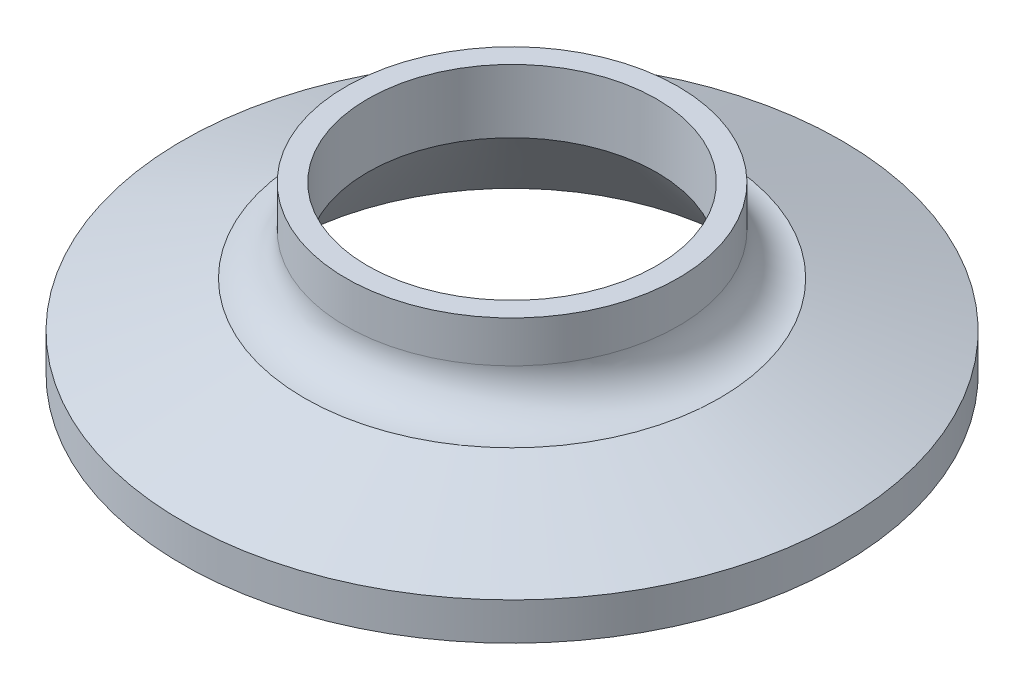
ISO-10303-21;
HEADER;
FILE_DESCRIPTION(('STEP AP214'),'2;1');
FILE_NAME('part.step','',(''),(''),'','','');
FILE_SCHEMA(('AUTOMOTIVE_DESIGN { 1 0 10303 214 1 1 1 1 }'));
ENDSEC;
DATA;
#1=APPLICATION_CONTEXT('core data for automotive mechanical design processes');
#2=APPLICATION_PROTOCOL_DEFINITION('international standard','automotive_design',2000,#1);
#3=PRODUCT_CONTEXT('',#1,'mechanical');
#4=PRODUCT('Part','Part','',(#3));
#5=PRODUCT_RELATED_PRODUCT_CATEGORY('part','',(#4));
#6=PRODUCT_DEFINITION_FORMATION('','',#4);
#7=PRODUCT_DEFINITION_CONTEXT('part definition',#1,'design');
#8=PRODUCT_DEFINITION('design','',#6,#7);
#9=PRODUCT_DEFINITION_SHAPE('','',#8);
#10=(LENGTH_UNIT() NAMED_UNIT(*) SI_UNIT(.MILLI.,.METRE.));
#11=(NAMED_UNIT(*) PLANE_ANGLE_UNIT() SI_UNIT($,.RADIAN.));
#12=(NAMED_UNIT(*) SI_UNIT($,.STERADIAN.) SOLID_ANGLE_UNIT());
#13=UNCERTAINTY_MEASURE_WITH_UNIT(LENGTH_MEASURE(1.E-05),#10,'distance_accuracy_value','');
#14=(GEOMETRIC_REPRESENTATION_CONTEXT(3) GLOBAL_UNCERTAINTY_ASSIGNED_CONTEXT((#13)) GLOBAL_UNIT_ASSIGNED_CONTEXT((#10,
#11,#12)) REPRESENTATION_CONTEXT('',''));
#15=CARTESIAN_POINT('',(0.,0.,0.));
#16=DIRECTION('',(0.,0.,1.));
#17=DIRECTION('',(1.,0.,0.));
#18=AXIS2_PLACEMENT_3D('',#15,#16,#17);
#19=CARTESIAN_POINT('',(-11.049,12.7,0.));
#20=DIRECTION('',(0.,-1.,0.));
#21=DIRECTION('',(0.,0.,-1.));
#22=AXIS2_PLACEMENT_3D('',#19,#20,#21);
#23=PLANE('',#22);
#24=CARTESIAN_POINT('',(0.,12.7,0.));
#25=DIRECTION('',(0.,-1.,0.));
#26=DIRECTION('',(0.,0.,-1.));
#27=AXIS2_PLACEMENT_3D('',#24,#25,#26);
#28=CIRCLE('',#27,12.7);
#29=CARTESIAN_POINT('',(0.,12.7,-12.7));
#30=VERTEX_POINT('',#29);
#31=EDGE_CURVE('E12',#30,#30,#28,.T.);
#32=ORIENTED_EDGE('',*,*,#31,.F.);
#33=EDGE_LOOP('',(#32));
#34=FACE_BOUND('',#33,.T.);
#35=CARTESIAN_POINT('',(0.,12.7,0.));
#36=DIRECTION('',(0.,-1.,0.));
#37=DIRECTION('',(0.,0.,-1.));
#38=AXIS2_PLACEMENT_3D('',#35,#36,#37);
#39=CIRCLE('',#38,11.049);
#40=CARTESIAN_POINT('',(0.,12.7,-11.049));
#41=VERTEX_POINT('',#40);
#42=EDGE_CURVE('E92',#41,#41,#39,.T.);
#43=ORIENTED_EDGE('',*,*,#42,.T.);
#44=EDGE_LOOP('',(#43));
#45=FACE_BOUND('',#44,.T.);
#46=ADVANCED_FACE('F43',(#34,#45),#23,.F.);
#47=CARTESIAN_POINT('',(0.,0.,0.));
#48=DIRECTION('',(0.,-1.,0.));
#49=DIRECTION('',(0.,0.,-1.));
#50=AXIS2_PLACEMENT_3D('',#47,#48,#49);
#51=CYLINDRICAL_SURFACE('',#50,12.7);
#52=CARTESIAN_POINT('',(0.,9.52500000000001,0.));
#53=DIRECTION('',(0.,-1.,0.));
#54=DIRECTION('',(0.,0.,-1.));
#55=AXIS2_PLACEMENT_3D('',#52,#53,#54);
#56=CIRCLE('',#55,12.7);
#57=CARTESIAN_POINT('',(0.,9.52500000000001,-12.7));
#58=VERTEX_POINT('',#57);
#59=EDGE_CURVE('E49',#58,#58,#56,.T.);
#60=ORIENTED_EDGE('',*,*,#59,.F.);
#61=EDGE_LOOP('',(#60));
#62=FACE_BOUND('',#61,.T.);
#63=ORIENTED_EDGE('',*,*,#31,.T.);
#64=EDGE_LOOP('',(#63));
#65=FACE_BOUND('',#64,.T.);
#66=ADVANCED_FACE('F171',(#62,#65),#51,.T.);
#67=CARTESIAN_POINT('',(0.,9.52500000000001,0.));
#68=DIRECTION('',(0.,-1.,0.));
#69=DIRECTION('',(0.,0.,-1.));
#70=AXIS2_PLACEMENT_3D('',#67,#68,#69);
#71=TOROIDAL_SURFACE('',#70,15.875,3.175);
#72=CARTESIAN_POINT('',(0.,6.34999999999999,0.));
#73=DIRECTION('',(0.,-1.,0.));
#74=DIRECTION('',(0.,0.,-1.));
#75=AXIS2_PLACEMENT_3D('',#72,#73,#74);
#76=CIRCLE('',#75,15.875);
#77=CARTESIAN_POINT('',(0.,6.35,-15.875));
#78=VERTEX_POINT('',#77);
#79=EDGE_CURVE('E53',#78,#78,#76,.T.);
#80=ORIENTED_EDGE('',*,*,#79,.F.);
#81=EDGE_LOOP('',(#80));
#82=FACE_BOUND('',#81,.T.);
#83=ORIENTED_EDGE('',*,*,#59,.T.);
#84=EDGE_LOOP('',(#83));
#85=FACE_BOUND('',#84,.T.);
#86=ADVANCED_FACE('F166',(#82,#85),#71,.F.);
#87=CARTESIAN_POINT('',(-15.875,6.34999999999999,0.));
#88=DIRECTION('',(0.,1.,0.));
#89=DIRECTION('',(0.,0.,1.));
#90=AXIS2_PLACEMENT_3D('',#87,#88,#89);
#91=PLANE('',#90);
#92=CARTESIAN_POINT('',(0.,6.34999999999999,0.));
#93=DIRECTION('',(0.,-1.,0.));
#94=DIRECTION('',(0.,0.,-1.));
#95=AXIS2_PLACEMENT_3D('',#92,#93,#94);
#96=CIRCLE('',#95,15.6301961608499);
#97=CARTESIAN_POINT('',(0.,6.35,-15.6301961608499));
#98=VERTEX_POINT('',#97);
#99=EDGE_CURVE('E57',#98,#98,#96,.T.);
#100=ORIENTED_EDGE('',*,*,#99,.F.);
#101=EDGE_LOOP('',(#100));
#102=FACE_BOUND('',#101,.T.);
#103=ORIENTED_EDGE('',*,*,#79,.T.);
#104=EDGE_LOOP('',(#103));
#105=FACE_BOUND('',#104,.T.);
#106=ADVANCED_FACE('F160',(#102,#105),#91,.F.);
#107=CARTESIAN_POINT('',(0.,6.34999999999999,0.));
#108=DIRECTION('',(0.,-1.,0.));
#109=DIRECTION('',(0.,0.,-1.));
#110=AXIS2_PLACEMENT_3D('',#107,#108,#109);
#111=CONICAL_SURFACE('',#110,15.6301961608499,1.22173047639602);
#112=CARTESIAN_POINT('',(0.,2.8680409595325,0.));
#113=DIRECTION('',(0.,-1.,0.));
#114=DIRECTION('',(0.,0.,-1.));
#115=AXIS2_PLACEMENT_3D('',#112,#113,#114);
#116=CIRCLE('',#115,25.1968);
#117=CARTESIAN_POINT('',(0.,2.8680409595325,-25.1968));
#118=VERTEX_POINT('',#117);
#119=EDGE_CURVE('E62',#118,#118,#116,.T.);
#120=ORIENTED_EDGE('',*,*,#119,.F.);
#121=EDGE_LOOP('',(#120));
#122=FACE_BOUND('',#121,.T.);
#123=ORIENTED_EDGE('',*,*,#99,.T.);
#124=EDGE_LOOP('',(#123));
#125=FACE_BOUND('',#124,.T.);
#126=ADVANCED_FACE('F154',(#122,#125),#111,.T.);
#127=CARTESIAN_POINT('',(0.,0.,0.));
#128=DIRECTION('',(0.,-1.,0.));
#129=DIRECTION('',(0.,0.,-1.));
#130=AXIS2_PLACEMENT_3D('',#127,#128,#129);
#131=CYLINDRICAL_SURFACE('',#130,25.1968);
#132=CARTESIAN_POINT('',(0.,0.,0.));
#133=DIRECTION('',(0.,-1.,0.));
#134=DIRECTION('',(0.,0.,-1.));
#135=AXIS2_PLACEMENT_3D('',#132,#133,#134);
#136=CIRCLE('',#135,25.1968);
#137=CARTESIAN_POINT('',(0.,0.,-25.1968));
#138=VERTEX_POINT('',#137);
#139=EDGE_CURVE('E65',#138,#138,#136,.T.);
#140=ORIENTED_EDGE('',*,*,#139,.F.);
#141=EDGE_LOOP('',(#140));
#142=FACE_BOUND('',#141,.T.);
#143=ORIENTED_EDGE('',*,*,#119,.T.);
#144=EDGE_LOOP('',(#143));
#145=FACE_BOUND('',#144,.T.);
#146=ADVANCED_FACE('F148',(#142,#145),#131,.T.);
#147=CARTESIAN_POINT('',(-25.1968,0.,0.));
#148=DIRECTION('',(0.,1.,0.));
#149=DIRECTION('',(0.,0.,1.));
#150=AXIS2_PLACEMENT_3D('',#147,#148,#149);
#151=PLANE('',#150);
#152=CARTESIAN_POINT('',(0.,0.,0.));
#153=DIRECTION('',(0.,-1.,0.));
#154=DIRECTION('',(0.,0.,-1.));
#155=AXIS2_PLACEMENT_3D('',#152,#153,#154);
#156=CIRCLE('',#155,23.8091722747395);
#157=CARTESIAN_POINT('',(0.,0.,-23.8091722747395));
#158=VERTEX_POINT('',#157);
#159=EDGE_CURVE('E68',#158,#158,#156,.T.);
#160=ORIENTED_EDGE('',*,*,#159,.F.);
#161=EDGE_LOOP('',(#160));
#162=FACE_BOUND('',#161,.T.);
#163=ORIENTED_EDGE('',*,*,#139,.T.);
#164=EDGE_LOOP('',(#163));
#165=FACE_BOUND('',#164,.T.);
#166=ADVANCED_FACE('F142',(#162,#165),#151,.F.);
#167=CARTESIAN_POINT('',(0.,0.787399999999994,0.));
#168=DIRECTION('',(0.,-1.,0.));
#169=DIRECTION('',(0.,0.,-1.));
#170=AXIS2_PLACEMENT_3D('',#167,#168,#169);
#171=TOROIDAL_SURFACE('',#170,23.8091722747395,0.787399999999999);
#172=CARTESIAN_POINT('',(0.,0.479738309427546,0.));
#173=DIRECTION('',(0.,-1.,0.));
#174=DIRECTION('',(0.,0.,-1.));
#175=AXIS2_PLACEMENT_3D('',#172,#173,#174);
#176=CIRCLE('',#175,23.0843667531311);
#177=CARTESIAN_POINT('',(0.,0.479738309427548,-23.0843667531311));
#178=VERTEX_POINT('',#177);
#179=EDGE_CURVE('E71',#178,#178,#176,.T.);
#180=ORIENTED_EDGE('',*,*,#179,.F.);
#181=EDGE_LOOP('',(#180));
#182=FACE_BOUND('',#181,.T.);
#183=ORIENTED_EDGE('',*,*,#159,.T.);
#184=EDGE_LOOP('',(#183));
#185=FACE_BOUND('',#184,.T.);
#186=ADVANCED_FACE('F136',(#182,#185),#171,.T.);
#187=CARTESIAN_POINT('',(0.,0.479738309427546,0.));
#188=DIRECTION('',(0.,-1.,0.));
#189=DIRECTION('',(0.,0.,-1.));
#190=AXIS2_PLACEMENT_3D('',#187,#188,#189);
#191=CONICAL_SURFACE('',#190,23.0843667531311,0.401425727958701);
#192=CARTESIAN_POINT('',(0.,0.872854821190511,0.));
#193=DIRECTION('',(0.,-1.,0.));
#194=DIRECTION('',(0.,0.,-1.));
#195=AXIS2_PLACEMENT_3D('',#192,#193,#194);
#196=CIRCLE('',#195,22.9174986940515);
#197=CARTESIAN_POINT('',(0.,0.872854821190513,-22.9174986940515));
#198=VERTEX_POINT('',#197);
#199=EDGE_CURVE('E74',#198,#198,#196,.T.);
#200=ORIENTED_EDGE('',*,*,#199,.F.);
#201=EDGE_LOOP('',(#200));
#202=FACE_BOUND('',#201,.T.);
#203=ORIENTED_EDGE('',*,*,#179,.T.);
#204=EDGE_LOOP('',(#203));
#205=FACE_BOUND('',#204,.T.);
#206=ADVANCED_FACE('F130',(#202,#205),#191,.F.);
#207=CARTESIAN_POINT('',(0.,0.406400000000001,0.));
#208=DIRECTION('',(0.,-1.,0.));
#209=DIRECTION('',(0.,0.,-1.));
#210=AXIS2_PLACEMENT_3D('',#207,#208,#209);
#211=TOROIDAL_SURFACE('',#210,21.8186,1.1938);
#212=CARTESIAN_POINT('',(0.,0.872854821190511,0.));
#213=DIRECTION('',(0.,-1.,0.));
#214=DIRECTION('',(0.,0.,-1.));
#215=AXIS2_PLACEMENT_3D('',#212,#213,#214);
#216=CIRCLE('',#215,20.7197013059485);
#217=CARTESIAN_POINT('',(0.,0.872854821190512,-20.7197013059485));
#218=VERTEX_POINT('',#217);
#219=EDGE_CURVE('E77',#218,#218,#216,.T.);
#220=ORIENTED_EDGE('',*,*,#219,.F.);
#221=EDGE_LOOP('',(#220));
#222=FACE_BOUND('',#221,.T.);
#223=ORIENTED_EDGE('',*,*,#199,.T.);
#224=EDGE_LOOP('',(#223));
#225=FACE_BOUND('',#224,.T.);
#226=ADVANCED_FACE('F124',(#222,#225),#211,.F.);
#227=CARTESIAN_POINT('',(0.,0.872854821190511,0.));
#228=DIRECTION('',(0.,1.,0.));
#229=DIRECTION('',(0.,0.,1.));
#230=AXIS2_PLACEMENT_3D('',#227,#228,#229);
#231=CONICAL_SURFACE('',#230,20.7197013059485,0.401425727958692);
#232=CARTESIAN_POINT('',(0.,0.479738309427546,0.));
#233=DIRECTION('',(0.,-1.,0.));
#234=DIRECTION('',(0.,0.,-1.));
#235=AXIS2_PLACEMENT_3D('',#232,#233,#234);
#236=CIRCLE('',#235,20.5528332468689);
#237=CARTESIAN_POINT('',(0.,0.479738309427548,-20.552833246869));
#238=VERTEX_POINT('',#237);
#239=EDGE_CURVE('E80',#238,#238,#236,.T.);
#240=ORIENTED_EDGE('',*,*,#239,.F.);
#241=EDGE_LOOP('',(#240));
#242=FACE_BOUND('',#241,.T.);
#243=ORIENTED_EDGE('',*,*,#219,.T.);
#244=EDGE_LOOP('',(#243));
#245=FACE_BOUND('',#244,.T.);
#246=ADVANCED_FACE('F118',(#242,#245),#231,.T.);
#247=CARTESIAN_POINT('',(0.,0.787399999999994,0.));
#248=DIRECTION('',(0.,-1.,0.));
#249=DIRECTION('',(0.,0.,-1.));
#250=AXIS2_PLACEMENT_3D('',#247,#248,#249);
#251=TOROIDAL_SURFACE('',#250,19.8280277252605,0.787399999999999);
#252=CARTESIAN_POINT('',(0.,0.,0.));
#253=DIRECTION('',(0.,-1.,0.));
#254=DIRECTION('',(0.,0.,-1.));
#255=AXIS2_PLACEMENT_3D('',#252,#253,#254);
#256=CIRCLE('',#255,19.8280277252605);
#257=CARTESIAN_POINT('',(0.,0.,-19.8280277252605));
#258=VERTEX_POINT('',#257);
#259=EDGE_CURVE('E83',#258,#258,#256,.T.);
#260=ORIENTED_EDGE('',*,*,#259,.F.);
#261=EDGE_LOOP('',(#260));
#262=FACE_BOUND('',#261,.T.);
#263=ORIENTED_EDGE('',*,*,#239,.T.);
#264=EDGE_LOOP('',(#263));
#265=FACE_BOUND('',#264,.T.);
#266=ADVANCED_FACE('F112',(#262,#265),#251,.T.);
#267=CARTESIAN_POINT('',(-19.8280277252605,0.,0.));
#268=DIRECTION('',(0.,1.,0.));
#269=DIRECTION('',(0.,0.,1.));
#270=AXIS2_PLACEMENT_3D('',#267,#268,#269);
#271=PLANE('',#270);
#272=CARTESIAN_POINT('',(0.,0.,0.));
#273=DIRECTION('',(0.,-1.,0.));
#274=DIRECTION('',(0.,0.,-1.));
#275=AXIS2_PLACEMENT_3D('',#272,#273,#274);
#276=CIRCLE('',#275,17.399);
#277=CARTESIAN_POINT('',(0.,0.,-17.399));
#278=VERTEX_POINT('',#277);
#279=EDGE_CURVE('E86',#278,#278,#276,.T.);
#280=ORIENTED_EDGE('',*,*,#279,.F.);
#281=EDGE_LOOP('',(#280));
#282=FACE_BOUND('',#281,.T.);
#283=ORIENTED_EDGE('',*,*,#259,.T.);
#284=EDGE_LOOP('',(#283));
#285=FACE_BOUND('',#284,.T.);
#286=ADVANCED_FACE('F106',(#282,#285),#271,.F.);
#287=CARTESIAN_POINT('',(0.,0.,0.));
#288=DIRECTION('',(0.,-1.,0.));
#289=DIRECTION('',(0.,0.,-1.));
#290=AXIS2_PLACEMENT_3D('',#287,#288,#289);
#291=CONICAL_SURFACE('',#290,17.399,0.680463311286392);
#292=CARTESIAN_POINT('',(0.,7.84504663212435,0.));
#293=DIRECTION('',(0.,-1.,0.));
#294=DIRECTION('',(0.,0.,-1.));
#295=AXIS2_PLACEMENT_3D('',#292,#293,#294);
#296=CIRCLE('',#295,11.049);
#297=CARTESIAN_POINT('',(0.,7.84504663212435,-11.049));
#298=VERTEX_POINT('',#297);
#299=EDGE_CURVE('E89',#298,#298,#296,.T.);
#300=ORIENTED_EDGE('',*,*,#299,.F.);
#301=EDGE_LOOP('',(#300));
#302=FACE_BOUND('',#301,.T.);
#303=ORIENTED_EDGE('',*,*,#279,.T.);
#304=EDGE_LOOP('',(#303));
#305=FACE_BOUND('',#304,.T.);
#306=ADVANCED_FACE('F100',(#302,#305),#291,.F.);
#307=CARTESIAN_POINT('',(0.,0.,0.));
#308=DIRECTION('',(0.,-1.,0.));
#309=DIRECTION('',(0.,0.,-1.));
#310=AXIS2_PLACEMENT_3D('',#307,#308,#309);
#311=CYLINDRICAL_SURFACE('',#310,11.049);
#312=ORIENTED_EDGE('',*,*,#42,.F.);
#313=EDGE_LOOP('',(#312));
#314=FACE_BOUND('',#313,.T.);
#315=ORIENTED_EDGE('',*,*,#299,.T.);
#316=EDGE_LOOP('',(#315));
#317=FACE_BOUND('',#316,.T.);
#318=ADVANCED_FACE('F97',(#314,#317),#311,.F.);
#319=CLOSED_SHELL('',(#46,#66,#86,#106,#126,#146,#166,#186,#206,#226,#246,#266,#286,#306,#318));
#320=MANIFOLD_SOLID_BREP('B2',#319);
#321=ADVANCED_BREP_SHAPE_REPRESENTATION('',(#18,#320),#14);
#322=SHAPE_DEFINITION_REPRESENTATION(#9,#321);
ENDSEC;
END-ISO-10303-21;
